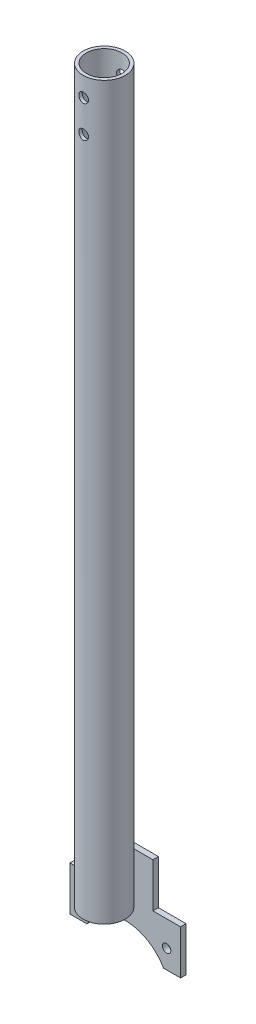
from build123d import *

# Parameters (mm, degrees)
SKETCH1_R          = 24.13
SKETCH1_R_2        = 20.447
EXTRUDE1_DEPTH     = 838.2
EXTRUDE2_DEPTH     = 6.35
SKETCH3_R          = 50.8
CUT_EXTRUDE1_DEPTH = 842.986055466
SKETCH5_R          = 4.826
CUT_EXTRUDE2_DEPTH = 843.373873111
SKETCH6_R          = 4.826
CUT_EXTRUDE3_DEPTH = 843.373873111
SKETCH7_R          = 5.5499
CUT_EXTRUDE6_DEPTH = 842.986055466


with BuildPart() as part:
    # Sketch1 → Extrude1 (new body)
    with BuildSketch(Plane(origin=(0, 0, 0), x_dir=(1, 0, 0), z_dir=(0, 1, 0))):
        with Locations(Location((0, 0, 0), (0, 0, 270))):
            Circle(SKETCH1_R)
        with Locations(Location((0, 0, 0), (0, 0, 270))):
            Circle(SKETCH1_R_2, mode=Mode.SUBTRACT)
    extrude(amount=EXTRUDE1_DEPTH)

    # Sketch7 → Cut-Extrude6 (cut, through all)
    with BuildSketch(Plane.XY.offset(-24.13)):
        with Locations(Location((0, 815.975, 0), (0, 0, 90.000000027))):
            Circle(SKETCH7_R)
        with Locations(Location((0, 779.4752, 0), (0, 0, 90.000000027))):
            Circle(SKETCH7_R)
    extrude(amount=CUT_EXTRUDE6_DEPTH, mode=Mode.SUBTRACT)


with BuildPart() as body_2:
    # Sketch2 → Extrude2 (new body)
    with BuildSketch(Plane.XY.offset(-24.13)):
        Polygon((63.5, -50.8), (-63.5, -50.8), (-63.5, 0), (-31.75, 0), (-31.75, 50.8), (31.75, 50.8), (31.75, 0), (63.5, 0), align=None)
    extrude(amount=-EXTRUDE2_DEPTH)

    # Sketch3 → Cut-Extrude1 (cut, through all)
    with BuildSketch(Plane.XY.offset(-24.13)):
        with Locations((0, -76.2)):
            Circle(SKETCH3_R)
    extrude(amount=-CUT_EXTRUDE1_DEPTH, mode=Mode.SUBTRACT)

    # Sketch5 → Cut-Extrude2 (cut, through all)
    with BuildSketch(Plane(origin=(0, 0, -30.48), x_dir=(-1, 0, 0), z_dir=(0, 0, -1))):
        with Locations((-47.472905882, -29.311734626)):
            Circle(SKETCH5_R)
    extrude(amount=-CUT_EXTRUDE2_DEPTH, mode=Mode.SUBTRACT)

    # Sketch6 → Cut-Extrude3 (cut, through all)
    with BuildSketch(Plane(origin=(0, 0, -30.48), x_dir=(-1, 0, 0), z_dir=(0, 0, -1))):
        with Locations((46.819783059, -29.303845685)):
            Circle(SKETCH6_R)
    extrude(amount=-CUT_EXTRUDE3_DEPTH, mode=Mode.SUBTRACT)


solid = Compound([part.part, body_2.part])
